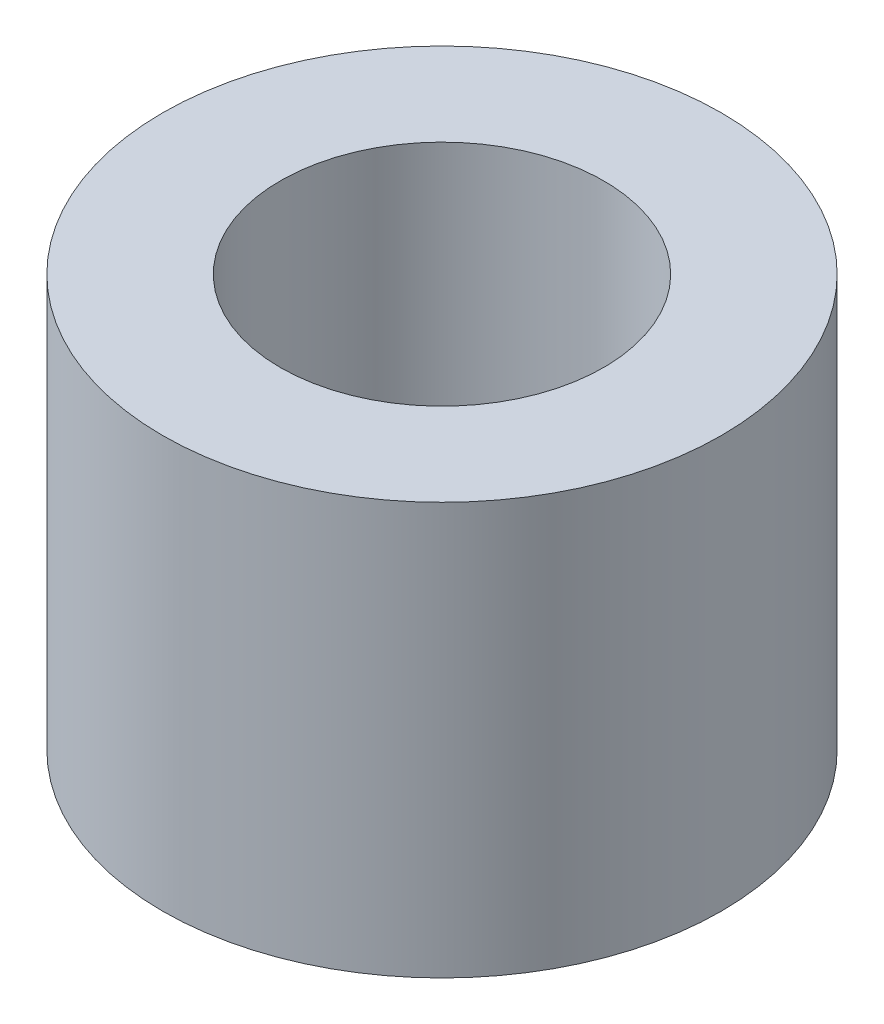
ISO-10303-21;
HEADER;
FILE_DESCRIPTION(('STEP AP214'),'2;1');
FILE_NAME('part.step','',(''),(''),'','','');
FILE_SCHEMA(('AUTOMOTIVE_DESIGN { 1 0 10303 214 1 1 1 1 }'));
ENDSEC;
DATA;
#1=APPLICATION_CONTEXT('core data for automotive mechanical design processes');
#2=APPLICATION_PROTOCOL_DEFINITION('international standard','automotive_design',2000,#1);
#3=PRODUCT_CONTEXT('',#1,'mechanical');
#4=PRODUCT('Part','Part','',(#3));
#5=PRODUCT_RELATED_PRODUCT_CATEGORY('part','',(#4));
#6=PRODUCT_DEFINITION_FORMATION('','',#4);
#7=PRODUCT_DEFINITION_CONTEXT('part definition',#1,'design');
#8=PRODUCT_DEFINITION('design','',#6,#7);
#9=PRODUCT_DEFINITION_SHAPE('','',#8);
#10=(LENGTH_UNIT() NAMED_UNIT(*) SI_UNIT(.MILLI.,.METRE.));
#11=(NAMED_UNIT(*) PLANE_ANGLE_UNIT() SI_UNIT($,.RADIAN.));
#12=(NAMED_UNIT(*) SI_UNIT($,.STERADIAN.) SOLID_ANGLE_UNIT());
#13=UNCERTAINTY_MEASURE_WITH_UNIT(LENGTH_MEASURE(1.E-05),#10,'distance_accuracy_value','');
#14=(GEOMETRIC_REPRESENTATION_CONTEXT(3) GLOBAL_UNCERTAINTY_ASSIGNED_CONTEXT((#13)) GLOBAL_UNIT_ASSIGNED_CONTEXT((#10,
#11,#12)) REPRESENTATION_CONTEXT('',''));
#15=CARTESIAN_POINT('',(0.,0.,0.));
#16=DIRECTION('',(0.,0.,1.));
#17=DIRECTION('',(1.,0.,0.));
#18=AXIS2_PLACEMENT_3D('',#15,#16,#17);
#19=CARTESIAN_POINT('',(0.,22.2249999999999,0.));
#20=DIRECTION('',(0.,1.,0.));
#21=DIRECTION('',(0.,0.,1.));
#22=AXIS2_PLACEMENT_3D('',#19,#20,#21);
#23=PLANE('',#22);
#24=CARTESIAN_POINT('',(0.,22.2249999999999,0.));
#25=DIRECTION('',(0.,1.,0.));
#26=DIRECTION('',(0.,0.,1.));
#27=AXIS2_PLACEMENT_3D('',#24,#25,#26);
#28=CIRCLE('',#27,15.0749);
#29=CARTESIAN_POINT('',(0.,22.2249999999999,15.0749));
#30=VERTEX_POINT('',#29);
#31=EDGE_CURVE('E10',#30,#30,#28,.T.);
#32=ORIENTED_EDGE('',*,*,#31,.T.);
#33=EDGE_LOOP('',(#32));
#34=FACE_BOUND('',#33,.T.);
#35=CARTESIAN_POINT('',(0.,22.2249999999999,0.));
#36=DIRECTION('',(0.,1.,0.));
#37=DIRECTION('',(0.,0.,1.));
#38=AXIS2_PLACEMENT_3D('',#35,#36,#37);
#39=CIRCLE('',#38,8.7249);
#40=CARTESIAN_POINT('',(0.,22.2249999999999,8.7249));
#41=VERTEX_POINT('',#40);
#42=EDGE_CURVE('E43',#41,#41,#39,.T.);
#43=ORIENTED_EDGE('',*,*,#42,.F.);
#44=EDGE_LOOP('',(#43));
#45=FACE_BOUND('',#44,.T.);
#46=ADVANCED_FACE('F32',(#34,#45),#23,.T.);
#47=CARTESIAN_POINT('',(0.,0.,0.));
#48=DIRECTION('',(0.,1.,0.));
#49=DIRECTION('',(0.,0.,1.));
#50=AXIS2_PLACEMENT_3D('',#47,#48,#49);
#51=PLANE('',#50);
#52=CARTESIAN_POINT('',(0.,0.,0.));
#53=DIRECTION('',(0.,1.,0.));
#54=DIRECTION('',(0.,0.,1.));
#55=AXIS2_PLACEMENT_3D('',#52,#53,#54);
#56=CIRCLE('',#55,15.0749);
#57=CARTESIAN_POINT('',(0.,0.,15.0749));
#58=VERTEX_POINT('',#57);
#59=EDGE_CURVE('E36',#58,#58,#56,.T.);
#60=ORIENTED_EDGE('',*,*,#59,.F.);
#61=EDGE_LOOP('',(#60));
#62=FACE_BOUND('',#61,.T.);
#63=CARTESIAN_POINT('',(0.,0.,0.));
#64=DIRECTION('',(0.,1.,0.));
#65=DIRECTION('',(0.,0.,1.));
#66=AXIS2_PLACEMENT_3D('',#63,#64,#65);
#67=CIRCLE('',#66,8.7249);
#68=CARTESIAN_POINT('',(0.,0.,8.7249));
#69=VERTEX_POINT('',#68);
#70=EDGE_CURVE('E45',#69,#69,#67,.T.);
#71=ORIENTED_EDGE('',*,*,#70,.T.);
#72=EDGE_LOOP('',(#71));
#73=FACE_BOUND('',#72,.T.);
#74=ADVANCED_FACE('F55',(#62,#73),#51,.F.);
#75=CARTESIAN_POINT('',(0.,22.2249999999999,0.));
#76=DIRECTION('',(0.,-1.,0.));
#77=DIRECTION('',(0.,0.,-1.));
#78=AXIS2_PLACEMENT_3D('',#75,#76,#77);
#79=CYLINDRICAL_SURFACE('',#78,15.0749);
#80=ORIENTED_EDGE('',*,*,#31,.F.);
#81=EDGE_LOOP('',(#80));
#82=FACE_BOUND('',#81,.T.);
#83=ORIENTED_EDGE('',*,*,#59,.T.);
#84=EDGE_LOOP('',(#83));
#85=FACE_BOUND('',#84,.T.);
#86=ADVANCED_FACE('F34',(#82,#85),#79,.T.);
#87=CARTESIAN_POINT('',(0.,22.2249999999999,0.));
#88=DIRECTION('',(0.,-1.,0.));
#89=DIRECTION('',(0.,0.,-1.));
#90=AXIS2_PLACEMENT_3D('',#87,#88,#89);
#91=CYLINDRICAL_SURFACE('',#90,8.7249);
#92=ORIENTED_EDGE('',*,*,#42,.T.);
#93=EDGE_LOOP('',(#92));
#94=FACE_BOUND('',#93,.T.);
#95=ORIENTED_EDGE('',*,*,#70,.F.);
#96=EDGE_LOOP('',(#95));
#97=FACE_BOUND('',#96,.T.);
#98=ADVANCED_FACE('F51',(#94,#97),#91,.F.);
#99=CLOSED_SHELL('',(#46,#74,#86,#98));
#100=MANIFOLD_SOLID_BREP('B2',#99);
#101=ADVANCED_BREP_SHAPE_REPRESENTATION('',(#18,#100),#14);
#102=SHAPE_DEFINITION_REPRESENTATION(#9,#101);
ENDSEC;
END-ISO-10303-21;
